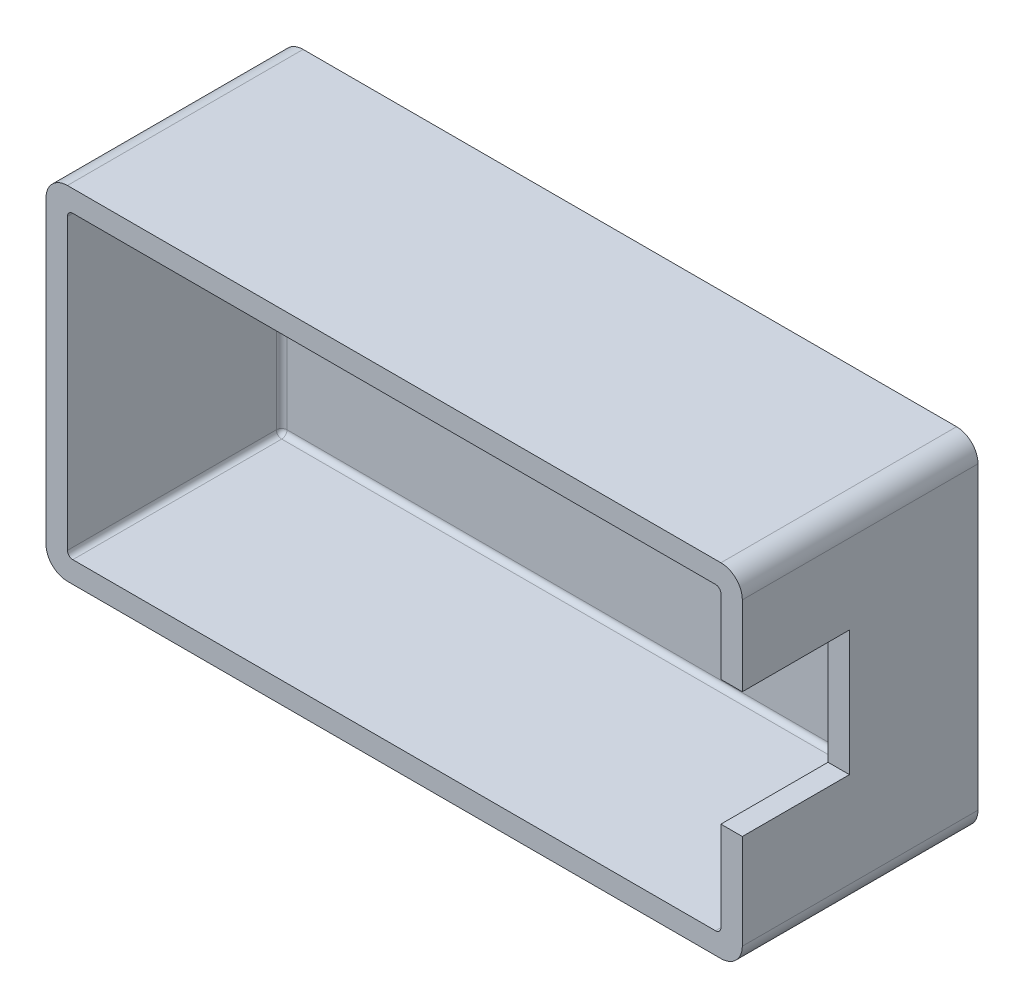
from build123d import *

# Parameters (mm, degrees)
ESQUISSE1_W             = 65
ESQUISSE1_H             = 32
BOSS_EXTRU_1_DEPTH      = 2
ESQUISSE2_W             = 65
ESQUISSE2_H             = 32
ESQUISSE2_W_2           = 61
ESQUISSE2_H_2           = 28
BOSS_EXTRU_2_DEPTH      = 20
ESQUISSE3_W             = 10
ESQUISSE3_H             = 11.7
ENL_V_MAT_EXTRU_1_DEPTH = 10
CONG_1_R                = 0.5
CONG_2_R                = 2


with BuildPart() as part:
    # Esquisse1 → Boss.-Extru.1 (new body)
    with BuildSketch(Plane.XY):
        with Locations((32.5, 16)):
            Rectangle(ESQUISSE1_W, ESQUISSE1_H)
    extrude(amount=BOSS_EXTRU_1_DEPTH)

    # Esquisse2 → Boss.-Extru.2 (add)
    with BuildSketch(Plane.XY.offset(2)):
        with Locations((32.5, 16)):
            Rectangle(ESQUISSE2_W, ESQUISSE2_H)
        with Locations((32.5, 16)):
            Rectangle(ESQUISSE2_W_2, ESQUISSE2_H_2, mode=Mode.SUBTRACT)
    extrude(amount=BOSS_EXTRU_2_DEPTH)

    # Esquisse3 → Enl_v. mat.-Extru.1 (cut)
    with BuildSketch(Plane.ZY.offset(-63)):
        with Locations((17, 16.720444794)):
            Rectangle(ESQUISSE3_W, ESQUISSE3_H)
    extrude(amount=-ENL_V_MAT_EXTRU_1_DEPTH, mode=Mode.SUBTRACT)

    # Cong_1
    cong_1_edges = [part.edges().sort_by_distance(p)[0] for p in [
        (32.5, 30, 2),
        (2, 16, 2),
        (32.5, 2, 2),
        (63, 16, 2),
        (2, 30, 12),
        (2, 2, 12),
        (63, 2, 12),
        (63, 30, 12),
    ]]
    fillet(cong_1_edges, radius=CONG_1_R)

    # Cong_2
    cong_2_edges = [part.edges().sort_by_distance(p)[0] for p in [
        (0, 32, 11),
        (65, 32, 11),
        (65, 0, 11),
        (0, 0, 11),
    ]]
    fillet(cong_2_edges, radius=CONG_2_R)


solid = part.part
